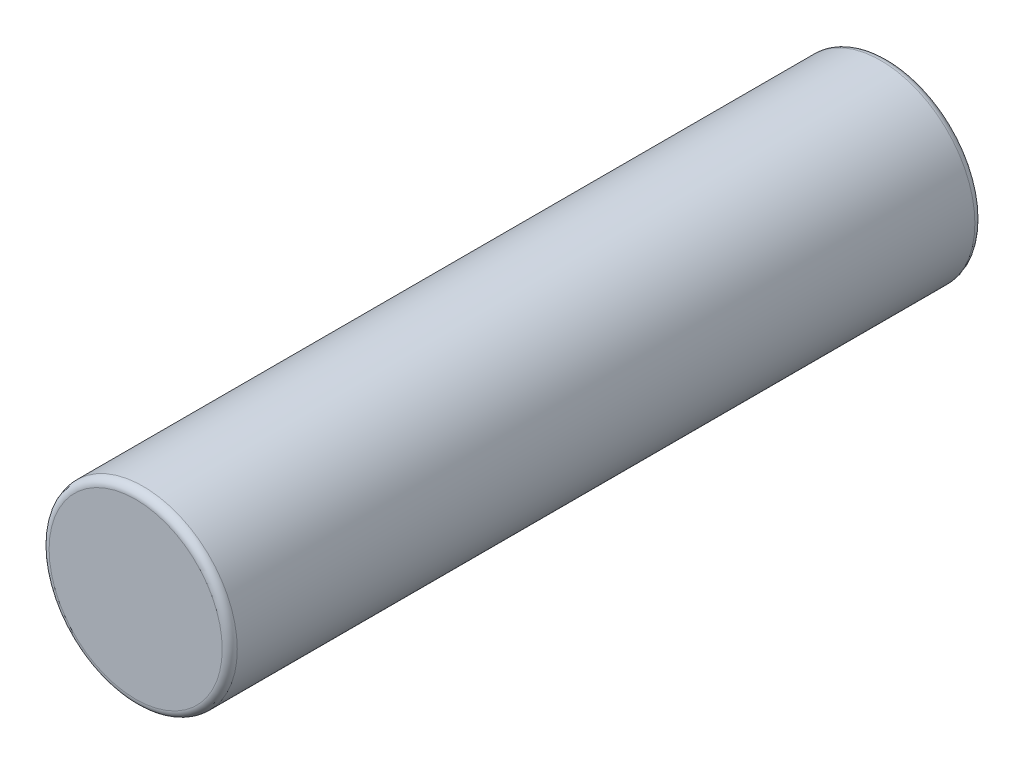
from build123d import *

# Parameters (mm, degrees)
ESQUISSE1_R      = 2.5
EXTRUSION1_DEPTH = 10
CONG_1_R         = 0.2


with BuildPart() as part:
    # Esquisse1 → Extrusion1 (new, symmetric)
    with BuildSketch(Plane.XY):
        Circle(ESQUISSE1_R)
    extrude(amount=EXTRUSION1_DEPTH, both=True)

    # Cong_1
    cong_1_edges = [part.edges().sort_by_distance(p)[0] for p in [
        (-2.5, 0, -10),
        (-2.5, 0, 10),
    ]]
    fillet(cong_1_edges, radius=CONG_1_R)


solid = part.part
